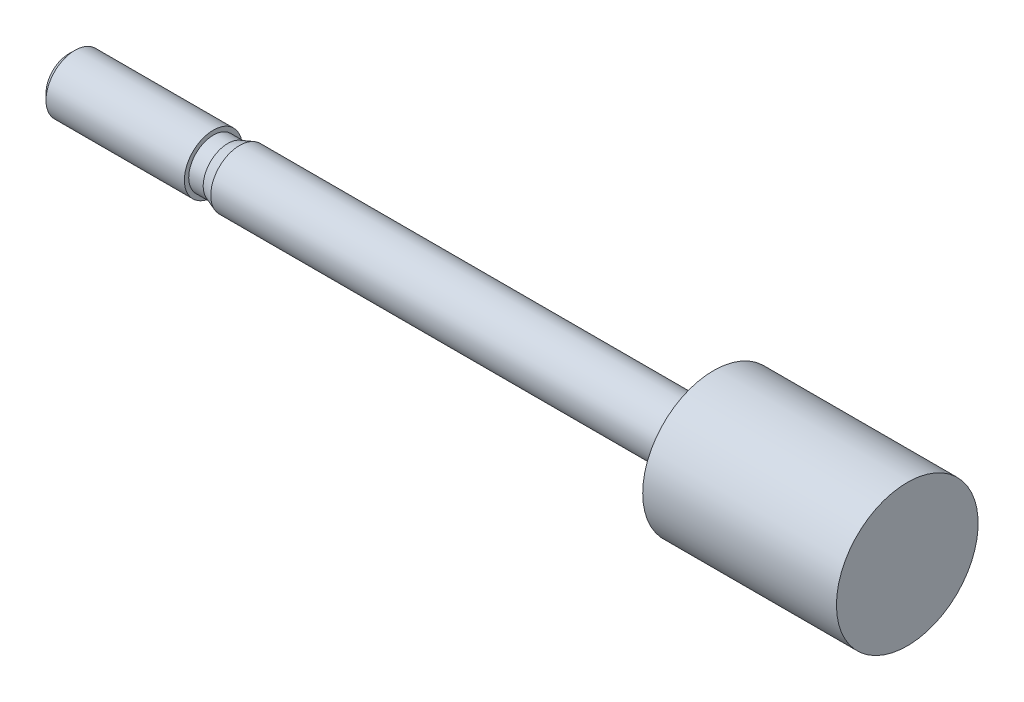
ISO-10303-21;
HEADER;
FILE_DESCRIPTION(('STEP AP214'),'2;1');
FILE_NAME('part.step','',(''),(''),'','','');
FILE_SCHEMA(('AUTOMOTIVE_DESIGN { 1 0 10303 214 1 1 1 1 }'));
ENDSEC;
DATA;
#1=APPLICATION_CONTEXT('core data for automotive mechanical design processes');
#2=APPLICATION_PROTOCOL_DEFINITION('international standard','automotive_design',2000,#1);
#3=PRODUCT_CONTEXT('',#1,'mechanical');
#4=PRODUCT('Part','Part','',(#3));
#5=PRODUCT_RELATED_PRODUCT_CATEGORY('part','',(#4));
#6=PRODUCT_DEFINITION_FORMATION('','',#4);
#7=PRODUCT_DEFINITION_CONTEXT('part definition',#1,'design');
#8=PRODUCT_DEFINITION('design','',#6,#7);
#9=PRODUCT_DEFINITION_SHAPE('','',#8);
#10=(LENGTH_UNIT() NAMED_UNIT(*) SI_UNIT(.MILLI.,.METRE.));
#11=(NAMED_UNIT(*) PLANE_ANGLE_UNIT() SI_UNIT($,.RADIAN.));
#12=(NAMED_UNIT(*) SI_UNIT($,.STERADIAN.) SOLID_ANGLE_UNIT());
#13=UNCERTAINTY_MEASURE_WITH_UNIT(LENGTH_MEASURE(1.E-05),#10,'distance_accuracy_value','');
#14=(GEOMETRIC_REPRESENTATION_CONTEXT(3) GLOBAL_UNCERTAINTY_ASSIGNED_CONTEXT((#13)) GLOBAL_UNIT_ASSIGNED_CONTEXT((#10,
#11,#12)) REPRESENTATION_CONTEXT('',''));
#15=CARTESIAN_POINT('',(0.,0.,0.));
#16=DIRECTION('',(0.,0.,1.));
#17=DIRECTION('',(1.,0.,0.));
#18=AXIS2_PLACEMENT_3D('',#15,#16,#17);
#19=CARTESIAN_POINT('',(-16.,0.,0.));
#20=DIRECTION('',(1.,0.,0.));
#21=DIRECTION('',(0.,0.,-1.));
#22=AXIS2_PLACEMENT_3D('',#19,#20,#21);
#23=PLANE('',#22);
#24=CARTESIAN_POINT('',(-16.,0.,0.));
#25=DIRECTION('',(-1.,0.,0.));
#26=DIRECTION('',(0.,0.,1.));
#27=AXIS2_PLACEMENT_3D('',#24,#25,#26);
#28=CIRCLE('',#27,1.5705);
#29=CARTESIAN_POINT('',(-16.,0.,1.5705));
#30=VERTEX_POINT('',#29);
#31=EDGE_CURVE('E10',#30,#30,#28,.T.);
#32=ORIENTED_EDGE('',*,*,#31,.T.);
#33=EDGE_LOOP('',(#32));
#34=FACE_BOUND('',#33,.T.);
#35=ADVANCED_FACE('F14',(#34),#23,.F.);
#36=CARTESIAN_POINT('',(-15.5705,0.,0.));
#37=DIRECTION('',(1.,0.,0.));
#38=DIRECTION('',(0.,0.,-1.));
#39=AXIS2_PLACEMENT_3D('',#36,#37,#38);
#40=CONICAL_SURFACE('',#39,2.,0.785398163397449);
#41=ORIENTED_EDGE('',*,*,#31,.F.);
#42=EDGE_LOOP('',(#41));
#43=FACE_BOUND('',#42,.T.);
#44=CARTESIAN_POINT('',(-15.5705,0.,0.));
#45=DIRECTION('',(-1.,0.,0.));
#46=DIRECTION('',(0.,0.,1.));
#47=AXIS2_PLACEMENT_3D('',#44,#45,#46);
#48=CIRCLE('',#47,2.);
#49=CARTESIAN_POINT('',(-15.5705,0.,2.));
#50=VERTEX_POINT('',#49);
#51=EDGE_CURVE('E20',#50,#50,#48,.T.);
#52=ORIENTED_EDGE('',*,*,#51,.T.);
#53=EDGE_LOOP('',(#52));
#54=FACE_BOUND('',#53,.T.);
#55=ADVANCED_FACE('F63',(#43,#54),#40,.T.);
#56=CARTESIAN_POINT('',(42.,0.,0.));
#57=DIRECTION('',(-1.,0.,0.));
#58=DIRECTION('',(0.,0.,1.));
#59=AXIS2_PLACEMENT_3D('',#56,#57,#58);
#60=CYLINDRICAL_SURFACE('',#59,2.);
#61=ORIENTED_EDGE('',*,*,#51,.F.);
#62=EDGE_LOOP('',(#61));
#63=FACE_BOUND('',#62,.T.);
#64=CARTESIAN_POINT('',(-6.,0.,0.));
#65=DIRECTION('',(-1.,0.,0.));
#66=DIRECTION('',(0.,0.,1.));
#67=AXIS2_PLACEMENT_3D('',#64,#65,#66);
#68=CIRCLE('',#67,2.);
#69=CARTESIAN_POINT('',(-6.,0.,2.));
#70=VERTEX_POINT('',#69);
#71=EDGE_CURVE('E24',#70,#70,#68,.T.);
#72=ORIENTED_EDGE('',*,*,#71,.T.);
#73=EDGE_LOOP('',(#72));
#74=FACE_BOUND('',#73,.T.);
#75=ADVANCED_FACE('F68',(#63,#74),#60,.T.);
#76=CARTESIAN_POINT('',(-6.,2.,0.));
#77=DIRECTION('',(-1.,0.,0.));
#78=DIRECTION('',(0.,0.,1.));
#79=AXIS2_PLACEMENT_3D('',#76,#77,#78);
#80=PLANE('',#79);
#81=ORIENTED_EDGE('',*,*,#71,.F.);
#82=EDGE_LOOP('',(#81));
#83=FACE_BOUND('',#82,.T.);
#84=CARTESIAN_POINT('',(-6.,0.,0.));
#85=DIRECTION('',(-1.,0.,0.));
#86=DIRECTION('',(0.,0.,1.));
#87=AXIS2_PLACEMENT_3D('',#84,#85,#86);
#88=CIRCLE('',#87,1.7);
#89=CARTESIAN_POINT('',(-6.,0.,1.7));
#90=VERTEX_POINT('',#89);
#91=EDGE_CURVE('E28',#90,#90,#88,.T.);
#92=ORIENTED_EDGE('',*,*,#91,.T.);
#93=EDGE_LOOP('',(#92));
#94=FACE_BOUND('',#93,.T.);
#95=ADVANCED_FACE('F75',(#83,#94),#80,.F.);
#96=CARTESIAN_POINT('',(42.,0.,0.));
#97=DIRECTION('',(-1.,0.,0.));
#98=DIRECTION('',(0.,0.,1.));
#99=AXIS2_PLACEMENT_3D('',#96,#97,#98);
#100=CYLINDRICAL_SURFACE('',#99,1.7);
#101=ORIENTED_EDGE('',*,*,#91,.F.);
#102=EDGE_LOOP('',(#101));
#103=FACE_BOUND('',#102,.T.);
#104=CARTESIAN_POINT('',(-5.,0.,0.));
#105=DIRECTION('',(-1.,0.,0.));
#106=DIRECTION('',(0.,0.,1.));
#107=AXIS2_PLACEMENT_3D('',#104,#105,#106);
#108=CIRCLE('',#107,1.7);
#109=CARTESIAN_POINT('',(-5.,0.,1.7));
#110=VERTEX_POINT('',#109);
#111=EDGE_CURVE('E33',#110,#110,#108,.T.);
#112=ORIENTED_EDGE('',*,*,#111,.T.);
#113=EDGE_LOOP('',(#112));
#114=FACE_BOUND('',#113,.T.);
#115=ADVANCED_FACE('F81',(#103,#114),#100,.T.);
#116=CARTESIAN_POINT('',(-4.17575677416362,0.,0.));
#117=DIRECTION('',(1.,0.,0.));
#118=DIRECTION('',(0.,0.,-1.));
#119=AXIS2_PLACEMENT_3D('',#116,#117,#118);
#120=CONICAL_SURFACE('',#119,2.,0.349065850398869);
#121=ORIENTED_EDGE('',*,*,#111,.F.);
#122=EDGE_LOOP('',(#121));
#123=FACE_BOUND('',#122,.T.);
#124=CARTESIAN_POINT('',(-4.17575677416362,0.,0.));
#125=DIRECTION('',(-1.,0.,0.));
#126=DIRECTION('',(0.,0.,1.));
#127=AXIS2_PLACEMENT_3D('',#124,#125,#126);
#128=CIRCLE('',#127,2.);
#129=CARTESIAN_POINT('',(-4.17575677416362,0.,2.));
#130=VERTEX_POINT('',#129);
#131=EDGE_CURVE('E36',#130,#130,#128,.T.);
#132=ORIENTED_EDGE('',*,*,#131,.T.);
#133=EDGE_LOOP('',(#132));
#134=FACE_BOUND('',#133,.T.);
#135=ADVANCED_FACE('F85',(#123,#134),#120,.T.);
#136=CARTESIAN_POINT('',(42.,0.,0.));
#137=DIRECTION('',(-1.,0.,0.));
#138=DIRECTION('',(0.,0.,1.));
#139=AXIS2_PLACEMENT_3D('',#136,#137,#138);
#140=CYLINDRICAL_SURFACE('',#139,2.);
#141=ORIENTED_EDGE('',*,*,#131,.F.);
#142=EDGE_LOOP('',(#141));
#143=FACE_BOUND('',#142,.T.);
#144=CARTESIAN_POINT('',(28.6,0.,0.));
#145=DIRECTION('',(-1.,0.,0.));
#146=DIRECTION('',(0.,0.,1.));
#147=AXIS2_PLACEMENT_3D('',#144,#145,#146);
#148=CIRCLE('',#147,2.);
#149=CARTESIAN_POINT('',(28.6,0.,2.));
#150=VERTEX_POINT('',#149);
#151=EDGE_CURVE('E39',#150,#150,#148,.T.);
#152=ORIENTED_EDGE('',*,*,#151,.T.);
#153=EDGE_LOOP('',(#152));
#154=FACE_BOUND('',#153,.T.);
#155=ADVANCED_FACE('F89',(#143,#154),#140,.T.);
#156=CARTESIAN_POINT('',(28.6,2.,0.));
#157=DIRECTION('',(1.,0.,0.));
#158=DIRECTION('',(0.,0.,-1.));
#159=AXIS2_PLACEMENT_3D('',#156,#157,#158);
#160=PLANE('',#159);
#161=ORIENTED_EDGE('',*,*,#151,.F.);
#162=EDGE_LOOP('',(#161));
#163=FACE_BOUND('',#162,.T.);
#164=CARTESIAN_POINT('',(28.6,0.,0.));
#165=DIRECTION('',(-1.,0.,0.));
#166=DIRECTION('',(0.,0.,1.));
#167=AXIS2_PLACEMENT_3D('',#164,#165,#166);
#168=CIRCLE('',#167,4.9);
#169=CARTESIAN_POINT('',(28.6,0.,4.9));
#170=VERTEX_POINT('',#169);
#171=EDGE_CURVE('E42',#170,#170,#168,.T.);
#172=ORIENTED_EDGE('',*,*,#171,.T.);
#173=EDGE_LOOP('',(#172));
#174=FACE_BOUND('',#173,.T.);
#175=ADVANCED_FACE('F59',(#163,#174),#160,.F.);
#176=CARTESIAN_POINT('',(42.,0.,0.));
#177=DIRECTION('',(-1.,0.,0.));
#178=DIRECTION('',(0.,0.,1.));
#179=AXIS2_PLACEMENT_3D('',#176,#177,#178);
#180=CYLINDRICAL_SURFACE('',#179,4.9);
#181=ORIENTED_EDGE('',*,*,#171,.F.);
#182=EDGE_LOOP('',(#181));
#183=FACE_BOUND('',#182,.T.);
#184=CARTESIAN_POINT('',(42.,0.,0.));
#185=DIRECTION('',(-1.,0.,0.));
#186=DIRECTION('',(0.,0.,1.));
#187=AXIS2_PLACEMENT_3D('',#184,#185,#186);
#188=CIRCLE('',#187,4.9);
#189=CARTESIAN_POINT('',(42.,0.,4.9));
#190=VERTEX_POINT('',#189);
#191=EDGE_CURVE('E45',#190,#190,#188,.T.);
#192=ORIENTED_EDGE('',*,*,#191,.T.);
#193=EDGE_LOOP('',(#192));
#194=FACE_BOUND('',#193,.T.);
#195=ADVANCED_FACE('F49',(#183,#194),#180,.T.);
#196=CARTESIAN_POINT('',(42.,4.9,0.));
#197=DIRECTION('',(-1.,0.,0.));
#198=DIRECTION('',(0.,0.,1.));
#199=AXIS2_PLACEMENT_3D('',#196,#197,#198);
#200=PLANE('',#199);
#201=ORIENTED_EDGE('',*,*,#191,.F.);
#202=EDGE_LOOP('',(#201));
#203=FACE_BOUND('',#202,.T.);
#204=ADVANCED_FACE('F51',(#203),#200,.F.);
#205=CLOSED_SHELL('',(#35,#55,#75,#95,#115,#135,#155,#175,#195,#204));
#206=MANIFOLD_SOLID_BREP('B1',#205);
#207=ADVANCED_BREP_SHAPE_REPRESENTATION('',(#18,#206),#14);
#208=SHAPE_DEFINITION_REPRESENTATION(#9,#207);
ENDSEC;
END-ISO-10303-21;
